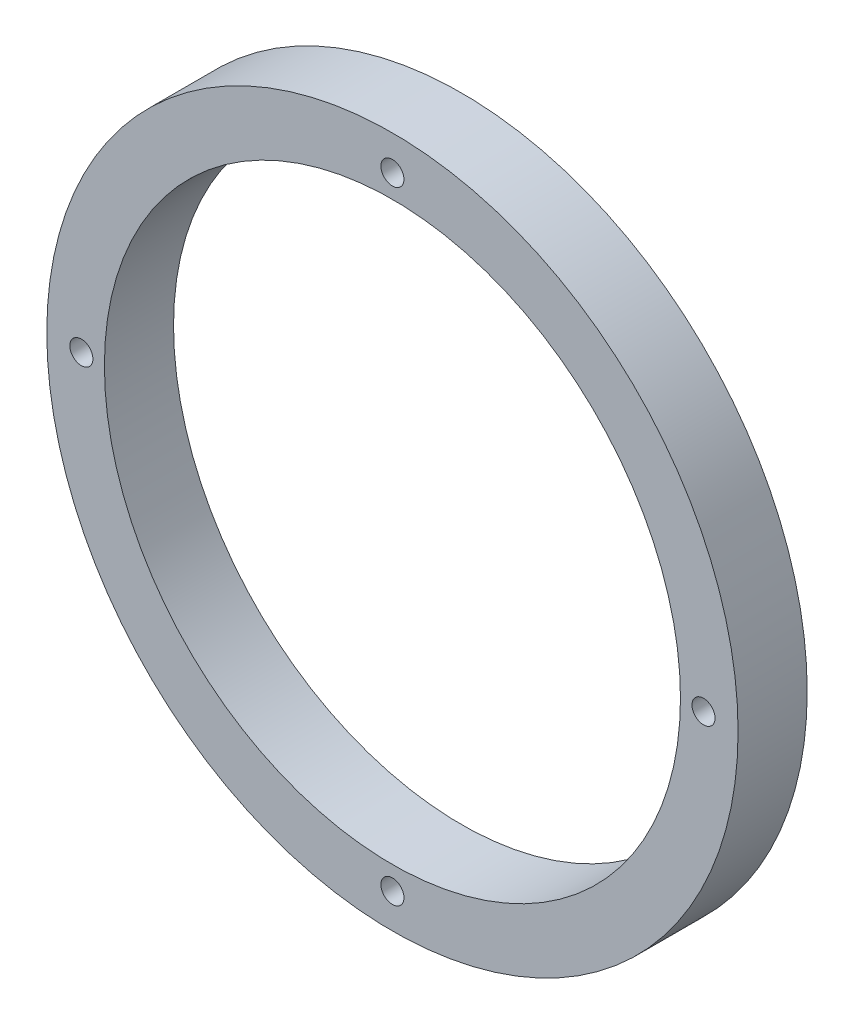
from build123d import *

# Parameters (mm, degrees)
ESQUISSE1_R                  = 15
ESQUISSE1_R_2                = 12.5
EXTRUSION1_DEPTH             = 3
ESQUISSE2_R                  = 0.5
ENL_V_MAT_EXTRU_1_DEPTH      = 22.424285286
R_P_TITION_CIRCULAIRE1_COUNT = 4


with BuildPart() as part:
    # Esquisse1 → Extrusion1 (new body)
    with BuildSketch(Plane.XY):
        Circle(ESQUISSE1_R)
        Circle(ESQUISSE1_R_2, mode=Mode.SUBTRACT)
    extrude(amount=EXTRUSION1_DEPTH)

    # Esquisse2 → Enl_v. mat.-Extru.1 (cut, through all)
    with BuildSketch(Plane.XY.offset(3)):
        with Locations((0, 13.5)):
            Circle(ESQUISSE2_R)
    enl_v_mat_extru_1 = extrude(amount=-ENL_V_MAT_EXTRU_1_DEPTH, mode=Mode.SUBTRACT)

    # R_p_tition circulaire1: Enl_v. mat.-Extru.1 ×4 about axis
    r_p_tition_circulaire1_axis = Axis((0, 0, 0), (0, 0, 1))
    for i in range(1, R_P_TITION_CIRCULAIRE1_COUNT):
        add(enl_v_mat_extru_1.rotate(r_p_tition_circulaire1_axis, i * 360 / R_P_TITION_CIRCULAIRE1_COUNT), mode=Mode.SUBTRACT)


solid = part.part
